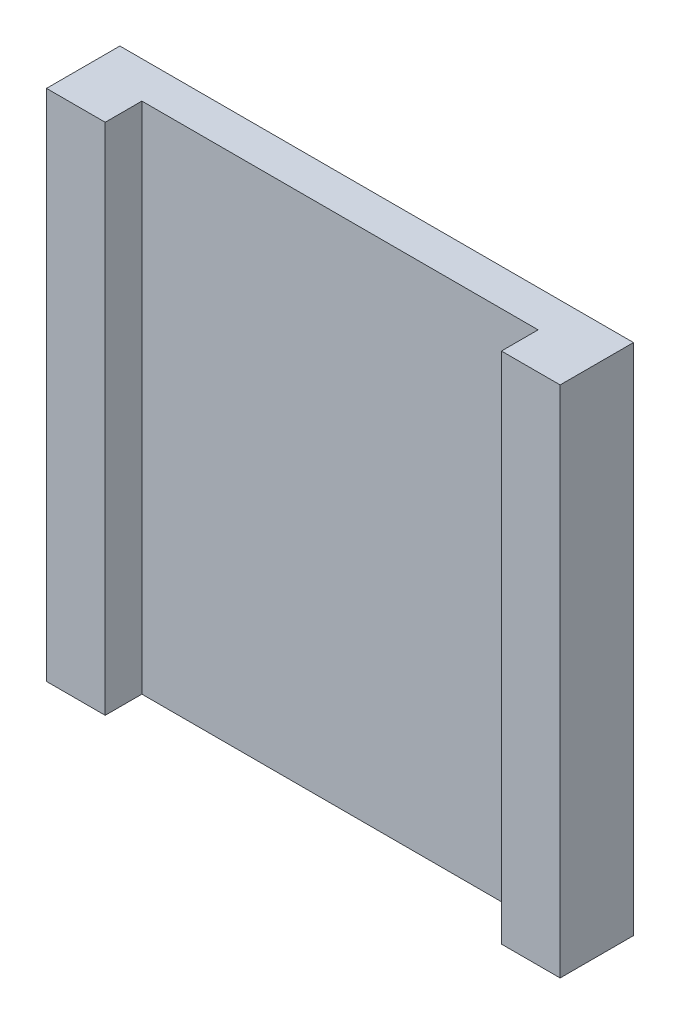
ISO-10303-21;
HEADER;
FILE_DESCRIPTION(('STEP AP214'),'2;1');
FILE_NAME('part.step','',(''),(''),'','','');
FILE_SCHEMA(('AUTOMOTIVE_DESIGN { 1 0 10303 214 1 1 1 1 }'));
ENDSEC;
DATA;
#1=APPLICATION_CONTEXT('core data for automotive mechanical design processes');
#2=APPLICATION_PROTOCOL_DEFINITION('international standard','automotive_design',2000,#1);
#3=PRODUCT_CONTEXT('',#1,'mechanical');
#4=PRODUCT('Part','Part','',(#3));
#5=PRODUCT_RELATED_PRODUCT_CATEGORY('part','',(#4));
#6=PRODUCT_DEFINITION_FORMATION('','',#4);
#7=PRODUCT_DEFINITION_CONTEXT('part definition',#1,'design');
#8=PRODUCT_DEFINITION('design','',#6,#7);
#9=PRODUCT_DEFINITION_SHAPE('','',#8);
#10=(LENGTH_UNIT() NAMED_UNIT(*) SI_UNIT(.MILLI.,.METRE.));
#11=(NAMED_UNIT(*) PLANE_ANGLE_UNIT() SI_UNIT($,.RADIAN.));
#12=(NAMED_UNIT(*) SI_UNIT($,.STERADIAN.) SOLID_ANGLE_UNIT());
#13=UNCERTAINTY_MEASURE_WITH_UNIT(LENGTH_MEASURE(1.E-05),#10,'distance_accuracy_value','');
#14=(GEOMETRIC_REPRESENTATION_CONTEXT(3) GLOBAL_UNCERTAINTY_ASSIGNED_CONTEXT((#13)) GLOBAL_UNIT_ASSIGNED_CONTEXT((#10,
#11,#12)) REPRESENTATION_CONTEXT('',''));
#15=CARTESIAN_POINT('',(0.,0.,0.));
#16=DIRECTION('',(0.,0.,1.));
#17=DIRECTION('',(1.,0.,0.));
#18=AXIS2_PLACEMENT_3D('',#15,#16,#17);
#19=CARTESIAN_POINT('',(0.,88.9,12.7));
#20=DIRECTION('',(0.,0.,-1.));
#21=DIRECTION('',(-1.,0.,0.));
#22=AXIS2_PLACEMENT_3D('',#19,#20,#21);
#23=PLANE('',#22);
#24=DIRECTION('',(1.,0.,0.));
#25=VECTOR('',#24,1.);
#26=CARTESIAN_POINT('',(0.,0.,12.7));
#27=LINE('',#26,#25);
#28=CARTESIAN_POINT('',(0.,0.,12.7));
#29=VERTEX_POINT('',#28);
#30=CARTESIAN_POINT('',(10.16,0.,12.7));
#31=VERTEX_POINT('',#30);
#32=EDGE_CURVE('E139',#29,#31,#27,.T.);
#33=ORIENTED_EDGE('',*,*,#32,.T.);
#34=DIRECTION('',(0.,1.,0.));
#35=VECTOR('',#34,1.);
#36=CARTESIAN_POINT('',(10.16,88.9,12.7));
#37=LINE('',#36,#35);
#38=CARTESIAN_POINT('',(10.16,88.9,12.7));
#39=VERTEX_POINT('',#38);
#40=EDGE_CURVE('E46',#31,#39,#37,.T.);
#41=ORIENTED_EDGE('',*,*,#40,.T.);
#42=DIRECTION('',(-1.,0.,0.));
#43=VECTOR('',#42,1.);
#44=CARTESIAN_POINT('',(0.,88.9,12.7));
#45=LINE('',#44,#43);
#46=CARTESIAN_POINT('',(0.,88.9,12.7));
#47=VERTEX_POINT('',#46);
#48=EDGE_CURVE('E61',#39,#47,#45,.T.);
#49=ORIENTED_EDGE('',*,*,#48,.T.);
#50=DIRECTION('',(0.,-1.,0.));
#51=VECTOR('',#50,1.);
#52=CARTESIAN_POINT('',(0.,0.,12.7));
#53=LINE('',#52,#51);
#54=EDGE_CURVE('E150',#47,#29,#53,.T.);
#55=ORIENTED_EDGE('',*,*,#54,.T.);
#56=EDGE_LOOP('',(#33,#41,#49,#55));
#57=FACE_BOUND('',#56,.T.);
#58=ADVANCED_FACE('F38',(#57),#23,.F.);
#59=CARTESIAN_POINT('',(0.,0.,12.7));
#60=DIRECTION('',(1.,0.,0.));
#61=DIRECTION('',(0.,0.,-1.));
#62=AXIS2_PLACEMENT_3D('',#59,#60,#61);
#63=PLANE('',#62);
#64=DIRECTION('',(0.,-1.,0.));
#65=VECTOR('',#64,1.);
#66=CARTESIAN_POINT('',(0.,0.,0.));
#67=LINE('',#66,#65);
#68=CARTESIAN_POINT('',(0.,88.9,0.));
#69=VERTEX_POINT('',#68);
#70=CARTESIAN_POINT('',(0.,0.,0.));
#71=VERTEX_POINT('',#70);
#72=EDGE_CURVE('E159',#69,#71,#67,.T.);
#73=ORIENTED_EDGE('',*,*,#72,.T.);
#74=DIRECTION('',(0.,0.,-1.));
#75=VECTOR('',#74,1.);
#76=CARTESIAN_POINT('',(0.,0.,12.7));
#77=LINE('',#76,#75);
#78=EDGE_CURVE('E111',#29,#71,#77,.T.);
#79=ORIENTED_EDGE('',*,*,#78,.F.);
#80=ORIENTED_EDGE('',*,*,#54,.F.);
#81=DIRECTION('',(0.,0.,-1.));
#82=VECTOR('',#81,1.);
#83=CARTESIAN_POINT('',(0.,88.9,12.7));
#84=LINE('',#83,#82);
#85=EDGE_CURVE('E125',#47,#69,#84,.T.);
#86=ORIENTED_EDGE('',*,*,#85,.T.);
#87=EDGE_LOOP('',(#73,#79,#80,#86));
#88=FACE_BOUND('',#87,.T.);
#89=ADVANCED_FACE('F40',(#88),#63,.F.);
#90=CARTESIAN_POINT('',(0.,0.,12.7));
#91=DIRECTION('',(0.,1.,0.));
#92=DIRECTION('',(0.,0.,1.));
#93=AXIS2_PLACEMENT_3D('',#90,#91,#92);
#94=PLANE('',#93);
#95=DIRECTION('',(-1.,0.,0.));
#96=VECTOR('',#95,1.);
#97=CARTESIAN_POINT('',(0.,0.,6.35));
#98=LINE('',#97,#96);
#99=CARTESIAN_POINT('',(78.74,0.,6.35));
#100=VERTEX_POINT('',#99);
#101=CARTESIAN_POINT('',(10.16,0.,6.35));
#102=VERTEX_POINT('',#101);
#103=EDGE_CURVE('E161',#100,#102,#98,.T.);
#104=ORIENTED_EDGE('',*,*,#103,.T.);
#105=DIRECTION('',(0.,0.,1.));
#106=VECTOR('',#105,1.);
#107=CARTESIAN_POINT('',(10.16,0.,12.7));
#108=LINE('',#107,#106);
#109=EDGE_CURVE('E164',#102,#31,#108,.T.);
#110=ORIENTED_EDGE('',*,*,#109,.T.);
#111=ORIENTED_EDGE('',*,*,#32,.F.);
#112=ORIENTED_EDGE('',*,*,#78,.T.);
#113=DIRECTION('',(1.,0.,0.));
#114=VECTOR('',#113,1.);
#115=CARTESIAN_POINT('',(0.,0.,0.));
#116=LINE('',#115,#114);
#117=CARTESIAN_POINT('',(88.9,0.,0.));
#118=VERTEX_POINT('',#117);
#119=EDGE_CURVE('E157',#71,#118,#116,.T.);
#120=ORIENTED_EDGE('',*,*,#119,.T.);
#121=DIRECTION('',(0.,0.,-1.));
#122=VECTOR('',#121,1.);
#123=CARTESIAN_POINT('',(88.9,0.,12.7));
#124=LINE('',#123,#122);
#125=CARTESIAN_POINT('',(88.9,0.,12.7));
#126=VERTEX_POINT('',#125);
#127=EDGE_CURVE('E134',#126,#118,#124,.T.);
#128=ORIENTED_EDGE('',*,*,#127,.F.);
#129=CARTESIAN_POINT('',(78.74,0.,12.7));
#130=VERTEX_POINT('',#129);
#131=EDGE_CURVE('E151',#130,#126,#27,.T.);
#132=ORIENTED_EDGE('',*,*,#131,.F.);
#133=DIRECTION('',(0.,0.,-1.));
#134=VECTOR('',#133,1.);
#135=CARTESIAN_POINT('',(78.74,0.,12.7));
#136=LINE('',#135,#134);
#137=EDGE_CURVE('E53',#130,#100,#136,.T.);
#138=ORIENTED_EDGE('',*,*,#137,.T.);
#139=EDGE_LOOP('',(#104,#110,#111,#112,#120,#128,#132,#138));
#140=FACE_BOUND('',#139,.T.);
#141=ADVANCED_FACE('F175',(#140),#94,.F.);
#142=CARTESIAN_POINT('',(88.9,0.,12.7));
#143=DIRECTION('',(-1.,0.,0.));
#144=DIRECTION('',(0.,0.,1.));
#145=AXIS2_PLACEMENT_3D('',#142,#143,#144);
#146=PLANE('',#145);
#147=DIRECTION('',(0.,1.,0.));
#148=VECTOR('',#147,1.);
#149=CARTESIAN_POINT('',(88.9,0.,0.));
#150=LINE('',#149,#148);
#151=CARTESIAN_POINT('',(88.9,88.9,0.));
#152=VERTEX_POINT('',#151);
#153=EDGE_CURVE('E153',#118,#152,#150,.T.);
#154=ORIENTED_EDGE('',*,*,#153,.T.);
#155=DIRECTION('',(0.,0.,-1.));
#156=VECTOR('',#155,1.);
#157=CARTESIAN_POINT('',(88.9,88.9,12.7));
#158=LINE('',#157,#156);
#159=CARTESIAN_POINT('',(88.9,88.9,12.7));
#160=VERTEX_POINT('',#159);
#161=EDGE_CURVE('E128',#160,#152,#158,.T.);
#162=ORIENTED_EDGE('',*,*,#161,.F.);
#163=DIRECTION('',(0.,1.,0.));
#164=VECTOR('',#163,1.);
#165=CARTESIAN_POINT('',(88.9,0.,12.7));
#166=LINE('',#165,#164);
#167=EDGE_CURVE('E123',#126,#160,#166,.T.);
#168=ORIENTED_EDGE('',*,*,#167,.F.);
#169=ORIENTED_EDGE('',*,*,#127,.T.);
#170=EDGE_LOOP('',(#154,#162,#168,#169));
#171=FACE_BOUND('',#170,.T.);
#172=ADVANCED_FACE('F179',(#171),#146,.F.);
#173=CARTESIAN_POINT('',(0.,88.9,12.7));
#174=DIRECTION('',(0.,-1.,0.));
#175=DIRECTION('',(0.,0.,-1.));
#176=AXIS2_PLACEMENT_3D('',#173,#174,#175);
#177=PLANE('',#176);
#178=ORIENTED_EDGE('',*,*,#48,.F.);
#179=DIRECTION('',(0.,0.,-1.));
#180=VECTOR('',#179,1.);
#181=CARTESIAN_POINT('',(10.16,88.9,12.7));
#182=LINE('',#181,#180);
#183=CARTESIAN_POINT('',(10.16,88.9,6.35));
#184=VERTEX_POINT('',#183);
#185=EDGE_CURVE('E142',#39,#184,#182,.T.);
#186=ORIENTED_EDGE('',*,*,#185,.T.);
#187=DIRECTION('',(1.,0.,0.));
#188=VECTOR('',#187,1.);
#189=CARTESIAN_POINT('',(0.,88.9,6.35));
#190=LINE('',#189,#188);
#191=CARTESIAN_POINT('',(78.74,88.9,6.35));
#192=VERTEX_POINT('',#191);
#193=EDGE_CURVE('E11',#184,#192,#190,.T.);
#194=ORIENTED_EDGE('',*,*,#193,.T.);
#195=DIRECTION('',(0.,0.,1.));
#196=VECTOR('',#195,1.);
#197=CARTESIAN_POINT('',(78.74,88.9,12.7));
#198=LINE('',#197,#196);
#199=CARTESIAN_POINT('',(78.74,88.9,12.7));
#200=VERTEX_POINT('',#199);
#201=EDGE_CURVE('E106',#192,#200,#198,.T.);
#202=ORIENTED_EDGE('',*,*,#201,.T.);
#203=EDGE_CURVE('E117',#160,#200,#45,.T.);
#204=ORIENTED_EDGE('',*,*,#203,.F.);
#205=ORIENTED_EDGE('',*,*,#161,.T.);
#206=DIRECTION('',(-1.,0.,0.));
#207=VECTOR('',#206,1.);
#208=CARTESIAN_POINT('',(0.,88.9,0.));
#209=LINE('',#208,#207);
#210=EDGE_CURVE('E145',#152,#69,#209,.T.);
#211=ORIENTED_EDGE('',*,*,#210,.T.);
#212=ORIENTED_EDGE('',*,*,#85,.F.);
#213=EDGE_LOOP('',(#178,#186,#194,#202,#204,#205,#211,#212));
#214=FACE_BOUND('',#213,.T.);
#215=ADVANCED_FACE('F115',(#214),#177,.F.);
#216=ORIENTED_EDGE('',*,*,#203,.T.);
#217=DIRECTION('',(0.,-1.,0.));
#218=VECTOR('',#217,1.);
#219=CARTESIAN_POINT('',(78.74,88.9,12.7));
#220=LINE('',#219,#218);
#221=EDGE_CURVE('E103',#200,#130,#220,.T.);
#222=ORIENTED_EDGE('',*,*,#221,.T.);
#223=ORIENTED_EDGE('',*,*,#131,.T.);
#224=ORIENTED_EDGE('',*,*,#167,.T.);
#225=EDGE_LOOP('',(#216,#222,#223,#224));
#226=FACE_BOUND('',#225,.T.);
#227=ADVANCED_FACE('F121',(#226),#23,.F.);
#228=CARTESIAN_POINT('',(0.,88.9,0.));
#229=DIRECTION('',(0.,0.,-1.));
#230=DIRECTION('',(-1.,0.,0.));
#231=AXIS2_PLACEMENT_3D('',#228,#229,#230);
#232=PLANE('',#231);
#233=ORIENTED_EDGE('',*,*,#72,.F.);
#234=ORIENTED_EDGE('',*,*,#210,.F.);
#235=ORIENTED_EDGE('',*,*,#153,.F.);
#236=ORIENTED_EDGE('',*,*,#119,.F.);
#237=EDGE_LOOP('',(#233,#234,#235,#236));
#238=FACE_BOUND('',#237,.T.);
#239=ADVANCED_FACE('F181',(#238),#232,.T.);
#240=CARTESIAN_POINT('',(10.16,-10.1850931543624,6.35));
#241=DIRECTION('',(0.,0.,-1.));
#242=DIRECTION('',(-1.,0.,0.));
#243=AXIS2_PLACEMENT_3D('',#240,#241,#242);
#244=PLANE('',#243);
#245=DIRECTION('',(0.,1.,0.));
#246=VECTOR('',#245,1.);
#247=CARTESIAN_POINT('',(78.74,-10.1850931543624,6.35));
#248=LINE('',#247,#246);
#249=EDGE_CURVE('E170',#100,#192,#248,.T.);
#250=ORIENTED_EDGE('',*,*,#249,.T.);
#251=ORIENTED_EDGE('',*,*,#193,.F.);
#252=DIRECTION('',(0.,-1.,0.));
#253=VECTOR('',#252,1.);
#254=CARTESIAN_POINT('',(10.16,98.2602920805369,6.35));
#255=LINE('',#254,#253);
#256=EDGE_CURVE('E119',#184,#102,#255,.T.);
#257=ORIENTED_EDGE('',*,*,#256,.T.);
#258=ORIENTED_EDGE('',*,*,#103,.F.);
#259=EDGE_LOOP('',(#250,#251,#257,#258));
#260=FACE_BOUND('',#259,.T.);
#261=ADVANCED_FACE('F172',(#260),#244,.F.);
#262=CARTESIAN_POINT('',(10.16,98.2602920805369,6.35));
#263=DIRECTION('',(-1.,0.,0.));
#264=DIRECTION('',(0.,-1.,0.));
#265=AXIS2_PLACEMENT_3D('',#262,#263,#264);
#266=PLANE('',#265);
#267=ORIENTED_EDGE('',*,*,#256,.F.);
#268=ORIENTED_EDGE('',*,*,#185,.F.);
#269=ORIENTED_EDGE('',*,*,#40,.F.);
#270=ORIENTED_EDGE('',*,*,#109,.F.);
#271=EDGE_LOOP('',(#267,#268,#269,#270));
#272=FACE_BOUND('',#271,.T.);
#273=ADVANCED_FACE('F182',(#272),#266,.F.);
#274=CARTESIAN_POINT('',(78.74,-10.1850931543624,6.35));
#275=DIRECTION('',(1.,0.,0.));
#276=DIRECTION('',(0.,0.,-1.));
#277=AXIS2_PLACEMENT_3D('',#274,#275,#276);
#278=PLANE('',#277);
#279=ORIENTED_EDGE('',*,*,#221,.F.);
#280=ORIENTED_EDGE('',*,*,#201,.F.);
#281=ORIENTED_EDGE('',*,*,#249,.F.);
#282=ORIENTED_EDGE('',*,*,#137,.F.);
#283=EDGE_LOOP('',(#279,#280,#281,#282));
#284=FACE_BOUND('',#283,.T.);
#285=ADVANCED_FACE('F105',(#284),#278,.F.);
#286=CLOSED_SHELL('',(#58,#89,#141,#172,#215,#227,#239,#261,#273,#285));
#287=MANIFOLD_SOLID_BREP('B2',#286);
#288=ADVANCED_BREP_SHAPE_REPRESENTATION('',(#18,#287),#14);
#289=SHAPE_DEFINITION_REPRESENTATION(#9,#288);
ENDSEC;
END-ISO-10303-21;
